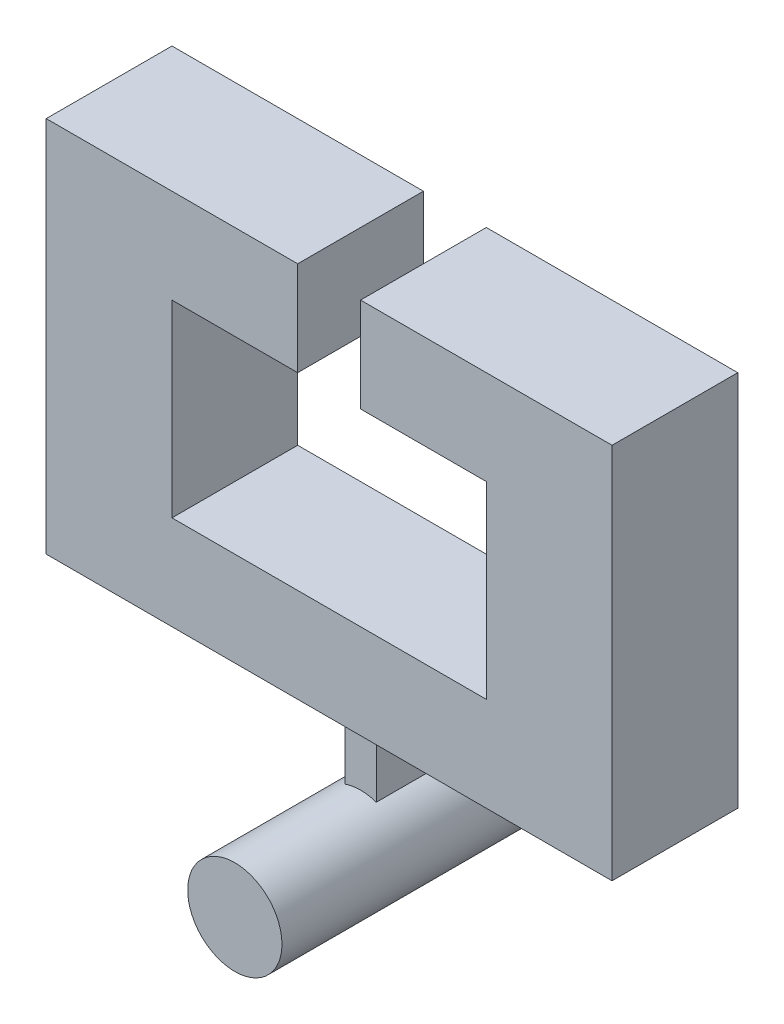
from build123d import *

# Parameters (mm, degrees)
SKETCH1_W           = 114.3
SKETCH1_H           = 76.2
BOSS_EXTRUDE1_DEPTH = 25.4
CUT_EXTRUDE1_REACH  = 141.7
BOSS_EXTRUDE2_DEPTH = 6.35
SKETCH5_5_R         = 9.525
BOSS_EXTRUDE3_DEPTH = 31.75


with BuildPart() as part:
    # Sketch1 → Boss-Extrude1 (new body)
    with BuildSketch(Plane.XY):
        with Locations((57.15, 38.1)):
            Rectangle(SKETCH1_W, SKETCH1_H)
    extrude(amount=BOSS_EXTRUDE1_DEPTH)

    # Sketch4 → Cut-Extrude1 (cut, up to next)
    with BuildSketch(Plane.XY.offset(25.4), mode=Mode.PRIVATE) as cut_extrude1_sk1:
        Polygon((63.5, 76.2), (50.8, 76.2), (50.8, 57.15), (25.4, 57.15), (25.4, 19.05), (88.9, 19.05), (88.9, 57.15), (63.5, 57.15), align=None)
    cut_extrude1_tool1 = extrude(cut_extrude1_sk1.sketch, amount=-CUT_EXTRUDE1_REACH, mode=Mode.PRIVATE) & part.part
    add(cut_extrude1_tool1.solids().sort_by_distance((57.15, 40.697727, 25.4))[0], mode=Mode.SUBTRACT)


with BuildPart() as body_2:
    # Sketch5 → Boss-Extrude2 (new, symmetric)
    with BuildSketch(Plane.XY.offset(12.7)):
        with BuildLine():
            Line((53.975, 0), (60.325, 0))
            Line((60.325, 0), (60.325, -16.419743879))
            ThreePointArc((60.325, -16.419743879), (57.15, -15.875), (53.975, -16.419743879))
            Line((53.975, -16.419743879), (53.975, 0))
        make_face()
    extrude(amount=BOSS_EXTRUDE2_DEPTH, both=True)


with BuildPart() as body_3:
    # Sketch5_5 → Boss-Extrude3 (new, symmetric)
    with BuildSketch(Plane.XY.offset(12.7)):
        with Locations((57.15, -25.4)):
            Circle(SKETCH5_5_R)
    extrude(amount=BOSS_EXTRUDE3_DEPTH, both=True)


solid = Compound([part.part, body_2.part, body_3.part])
